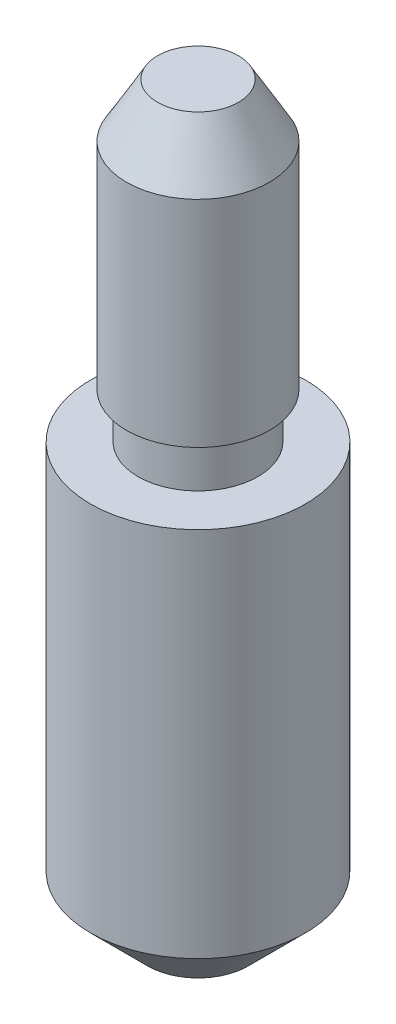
from build123d import *

# Parameters (mm, degrees)
CHAMFER1_SIZE = 1.27


with BuildPart() as part:
    # Sketch1 → Revolve1 (revolve)
    with BuildSketch(Plane(origin=(0, 0, 0), x_dir=(0, 0, -1), z_dir=(1, 0, 0)), mode=Mode.PRIVATE) as revolve1_sk:
        Polygon((0, -9.525), (2.3876, -9.525), (2.3876, 0), (1.3335, 0), (1.3335, 1.016), (1.5875, 1.016), (1.5875, 5.7912), (0.898259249, 6.985), (0, 6.985), align=None)
    revolve(revolve1_sk.sketch.rotate(Axis((0, 5.502483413, 0), (0, -1, 0)), 180), axis=Axis((0, 5.502483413, 0), (0, -1, 0)))

    # Chamfer1
    chamfer1_edges = [part.edges().sort_by_distance(p)[0] for p in [
        (0, -9.525, -2.3876),
    ]]
    chamfer(chamfer1_edges, length=CHAMFER1_SIZE)


solid = part.part
